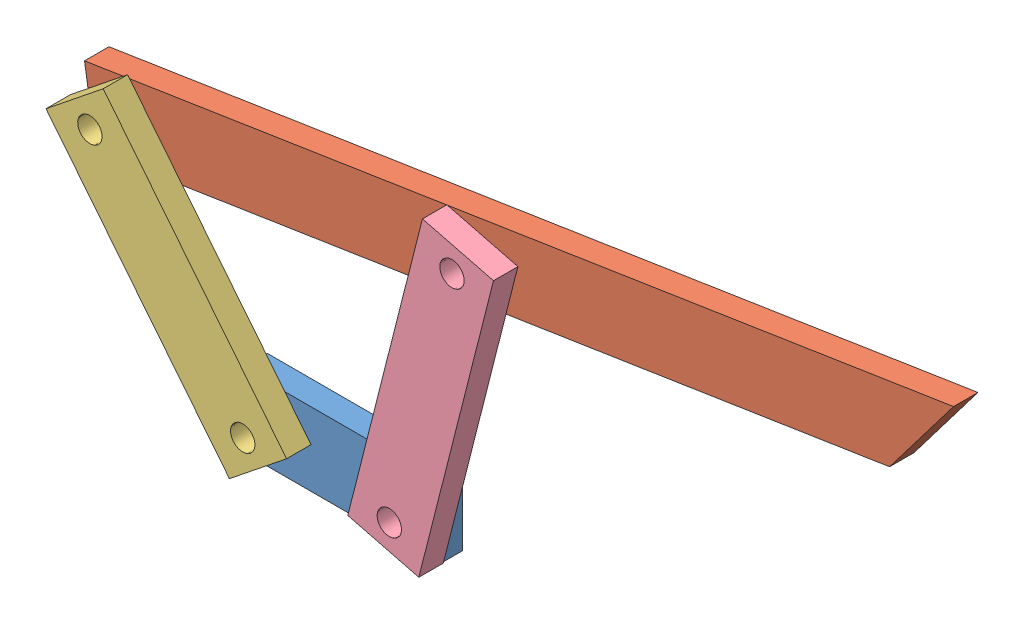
SolidWorks assembly Zusammenbau.SLDASM, configuration Standard (file format 3400). Lengths in mm.
Overall size (366.11 170.64 20).
4 component instances, 4 part files, 5 mates.
Components (placement in the parent):
- Grundteil 1-1: Grundteil 1.SLDPRT [Standard] at (59.4318 -3.0051 -5) size (80 30 10)
- Grundteil 2-1: Grundteil 2.SLDPRT [Standard] at (-1.9049 89.0001 -5) x (0.988135 0.153588 0) z (0 0 1) size (360 30 10)
- Grundteil 3-1: Grundteil 3.SLDPRT [Standard] at (-75.1829 91.5847 5) x (-0.625727 0.780042 0) z (0 0 1) size (120 30 10)
- Grundteil 4-1: Grundteil 4.SLDPRT [Standard] at (432.1392 -473.8135 5) x (0.870224 0.492656 0) z (0 0 1) size (107.6 110.49 10)
Mates (geometry in assembly coordinates):
- Deckungsgleich1: coincident aligned: circle of Grundteil 1-1; circle of Grundteil 3-1
- Deckungsgleich7: coincident aligned: circle of Grundteil 2-1; circle of Grundteil 3-1
- Deckungsgleich8: coincident anti-aligned: plane of Grundteil 1-1 through (-40.5682 -3.0051 5) normal (0 0 1); plane of Grundteil 4-1 through (41.5105 -1.3881 5) normal (0 0 -1)
- Konzentrisch1: concentric aligned: circle of Grundteil 2-1; circle of Grundteil 4-1
- Konzentrisch2: concentric aligned: circle of Grundteil 1-1; circle of Grundteil 4-1
